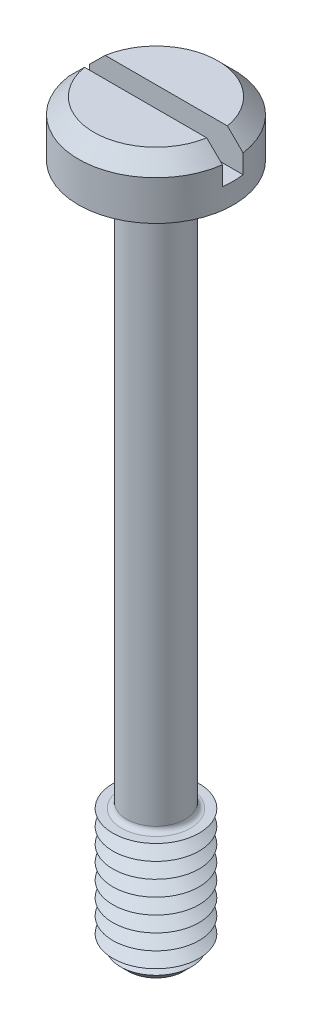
ISO-10303-21;
HEADER;
FILE_DESCRIPTION(('STEP AP214'),'2;1');
FILE_NAME('part.step','',(''),(''),'','','');
FILE_SCHEMA(('AUTOMOTIVE_DESIGN { 1 0 10303 214 1 1 1 1 }'));
ENDSEC;
DATA;
#1=APPLICATION_CONTEXT('core data for automotive mechanical design processes');
#2=APPLICATION_PROTOCOL_DEFINITION('international standard','automotive_design',2000,#1);
#3=PRODUCT_CONTEXT('',#1,'mechanical');
#4=PRODUCT('Part','Part','',(#3));
#5=PRODUCT_RELATED_PRODUCT_CATEGORY('part','',(#4));
#6=PRODUCT_DEFINITION_FORMATION('','',#4);
#7=PRODUCT_DEFINITION_CONTEXT('part definition',#1,'design');
#8=PRODUCT_DEFINITION('design','',#6,#7);
#9=PRODUCT_DEFINITION_SHAPE('','',#8);
#10=(LENGTH_UNIT() NAMED_UNIT(*) SI_UNIT(.MILLI.,.METRE.));
#11=(NAMED_UNIT(*) PLANE_ANGLE_UNIT() SI_UNIT($,.RADIAN.));
#12=(NAMED_UNIT(*) SI_UNIT($,.STERADIAN.) SOLID_ANGLE_UNIT());
#13=UNCERTAINTY_MEASURE_WITH_UNIT(LENGTH_MEASURE(1.E-05),#10,'distance_accuracy_value','');
#14=(GEOMETRIC_REPRESENTATION_CONTEXT(3) GLOBAL_UNCERTAINTY_ASSIGNED_CONTEXT((#13)) GLOBAL_UNIT_ASSIGNED_CONTEXT((#10,
#11,#12)) REPRESENTATION_CONTEXT('',''));
#15=CARTESIAN_POINT('',(0.,0.,0.));
#16=DIRECTION('',(0.,0.,1.));
#17=DIRECTION('',(1.,0.,0.));
#18=AXIS2_PLACEMENT_3D('',#15,#16,#17);
#19=CARTESIAN_POINT('',(0.,1.6,0.));
#20=DIRECTION('',(0.,1.,0.));
#21=DIRECTION('',(0.,0.,1.));
#22=AXIS2_PLACEMENT_3D('',#19,#20,#21);
#23=PLANE('',#22);
#24=DIRECTION('',(-1.,0.,0.));
#25=VECTOR('',#24,1.);
#26=CARTESIAN_POINT('',(2.25,1.6,-0.3));
#27=LINE('',#26,#25);
#28=CARTESIAN_POINT('',(1.77482393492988,1.6,-0.3));
#29=VERTEX_POINT('',#28);
#30=CARTESIAN_POINT('',(-1.77482393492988,1.6,-0.3));
#31=VERTEX_POINT('',#30);
#32=EDGE_CURVE('E110',#29,#31,#27,.T.);
#33=ORIENTED_EDGE('',*,*,#32,.F.);
#34=CARTESIAN_POINT('',(0.,1.6,0.));
#35=DIRECTION('',(0.,1.,0.));
#36=DIRECTION('',(0.,0.,1.));
#37=AXIS2_PLACEMENT_3D('',#34,#35,#36);
#38=CIRCLE('',#37,1.8);
#39=EDGE_CURVE('E113',#29,#31,#38,.T.);
#40=ORIENTED_EDGE('',*,*,#39,.T.);
#41=EDGE_LOOP('',(#33,#40));
#42=FACE_BOUND('',#41,.T.);
#43=ADVANCED_FACE('F39',(#42),#23,.T.);
#44=CARTESIAN_POINT('',(0.,1.6,0.));
#45=DIRECTION('',(0.,-1.,0.));
#46=DIRECTION('',(0.,0.,-1.));
#47=AXIS2_PLACEMENT_3D('',#44,#45,#46);
#48=CONICAL_SURFACE('',#47,1.8,0.785398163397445);
#49=CARTESIAN_POINT('',(4.95459224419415,-1.56366641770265,-0.3));
#50=CARTESIAN_POINT('',(4.78550585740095,-1.39489159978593,-0.3));
#51=CARTESIAN_POINT('',(4.61640599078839,-1.22613027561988,-0.3));
#52=CARTESIAN_POINT('',(4.27815962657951,-0.888649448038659,-0.3));
#53=CARTESIAN_POINT('',(4.10901312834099,-0.719929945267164,-0.3));
#54=CARTESIAN_POINT('',(3.77060374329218,-0.382497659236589,-0.3));
#55=CARTESIAN_POINT('',(3.60134083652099,-0.213784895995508,-0.3));
#56=CARTESIAN_POINT('',(3.26272497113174,0.123545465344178,-0.3));
#57=CARTESIAN_POINT('',(3.09337201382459,0.292163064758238,-0.3));
#58=CARTESIAN_POINT('',(2.74975444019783,0.633985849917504,-0.3));
#59=CARTESIAN_POINT('',(2.57548557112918,0.807186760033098,-0.3));
#60=CARTESIAN_POINT('',(2.22666801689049,1.15332162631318,-0.3));
#61=CARTESIAN_POINT('',(2.05211932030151,1.32625557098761,-0.3));
#62=CARTESIAN_POINT('',(1.78988225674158,1.58520097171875,-0.3));
#63=CARTESIAN_POINT('',(1.70241000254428,1.67143125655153,-0.3));
#64=CARTESIAN_POINT('',(1.52723599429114,1.84366185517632,-0.3));
#65=CARTESIAN_POINT('',(1.43953423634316,1.92966216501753,-0.3));
#66=CARTESIAN_POINT('',(1.26375483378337,2.10126365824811,-0.3));
#67=CARTESIAN_POINT('',(1.17567721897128,2.18686487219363,-0.3));
#68=CARTESIAN_POINT('',(0.998839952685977,2.35735922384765,-0.3));
#69=CARTESIAN_POINT('',(0.910080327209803,2.44225238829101,-0.3));
#70=CARTESIAN_POINT('',(0.796416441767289,2.54899153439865,-0.3));
#71=CARTESIAN_POINT('',(0.772225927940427,2.5715963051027,-0.3));
#72=CARTESIAN_POINT('',(0.723692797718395,2.61664290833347,-0.3));
#73=CARTESIAN_POINT('',(0.69935017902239,2.63908473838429,-0.3));
#74=CARTESIAN_POINT('',(0.65052808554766,2.68369783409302,-0.3));
#75=CARTESIAN_POINT('',(0.626049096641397,2.70586963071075,-0.3));
#76=CARTESIAN_POINT('',(0.576826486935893,2.74991696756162,-0.3));
#77=CARTESIAN_POINT('',(0.552082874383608,2.7717925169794,-0.3));
#78=CARTESIAN_POINT('',(0.495367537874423,2.82108684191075,-0.3));
#79=CARTESIAN_POINT('',(0.463281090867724,2.84837386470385,-0.3));
#80=CARTESIAN_POINT('',(0.398023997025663,2.90193742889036,-0.3));
#81=CARTESIAN_POINT('',(0.364849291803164,2.92820913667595,-0.3));
#82=CARTESIAN_POINT('',(0.313679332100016,2.96610502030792,-0.3));
#83=CARTESIAN_POINT('',(0.296293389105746,2.97854603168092,-0.3));
#84=CARTESIAN_POINT('',(0.260958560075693,3.00259516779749,-0.3));
#85=CARTESIAN_POINT('',(0.243009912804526,3.01420363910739,-0.3));
#86=CARTESIAN_POINT('',(0.206442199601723,3.03612496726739,-0.3));
#87=CARTESIAN_POINT('',(0.187826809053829,3.04644383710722,-0.3));
#88=CARTESIAN_POINT('',(0.149667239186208,3.06515059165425,-0.3));
#89=CARTESIAN_POINT('',(0.130125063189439,3.0735424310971,-0.3));
#90=CARTESIAN_POINT('',(0.0899770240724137,3.08736060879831,-0.3));
#91=CARTESIAN_POINT('',(0.0693720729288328,3.09278944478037,-0.3));
#92=CARTESIAN_POINT('',(0.0275643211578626,3.09943051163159,-0.3));
#93=CARTESIAN_POINT('',(0.00636584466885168,3.1006678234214,-0.3));
#94=CARTESIAN_POINT('',(-0.0358007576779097,3.09861060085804,-0.3));
#95=CARTESIAN_POINT('',(-0.0567687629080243,3.09531379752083,-0.3));
#96=CARTESIAN_POINT('',(-0.0978737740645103,3.08507807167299,-0.3));
#97=CARTESIAN_POINT('',(-0.11800430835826,3.07811501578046,-0.3));
#98=CARTESIAN_POINT('',(-0.16248330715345,3.05957916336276,-0.3));
#99=CARTESIAN_POINT('',(-0.186511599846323,3.04727044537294,-0.3));
#100=CARTESIAN_POINT('',(-0.233318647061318,3.02043354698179,-0.3));
#101=CARTESIAN_POINT('',(-0.256093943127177,3.00589960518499,-0.3));
#102=CARTESIAN_POINT('',(-0.300901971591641,2.97541580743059,-0.3));
#103=CARTESIAN_POINT('',(-0.322928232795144,2.95945657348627,-0.3));
#104=CARTESIAN_POINT('',(-0.366316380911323,2.92672827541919,-0.3));
#105=CARTESIAN_POINT('',(-0.387679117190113,2.90996032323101,-0.3));
#106=CARTESIAN_POINT('',(-0.43339480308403,2.87310399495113,-0.3));
#107=CARTESIAN_POINT('',(-0.457669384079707,2.85291891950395,-0.3));
#108=CARTESIAN_POINT('',(-0.505802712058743,2.81205752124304,-0.3));
#109=CARTESIAN_POINT('',(-0.529661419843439,2.79138115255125,-0.3));
#110=CARTESIAN_POINT('',(-0.600811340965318,2.72884009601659,-0.3));
#111=CARTESIAN_POINT('',(-0.647661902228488,2.68647545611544,-0.3));
#112=CARTESIAN_POINT('',(-0.740776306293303,2.60099002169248,-0.3));
#113=CARTESIAN_POINT('',(-0.787039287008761,2.55786829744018,-0.3));
#114=CARTESIAN_POINT('',(-0.879151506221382,2.47120207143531,-0.3));
#115=CARTESIAN_POINT('',(-0.925000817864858,2.4276576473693,-0.3));
#116=CARTESIAN_POINT('',(-1.06157343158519,2.29718252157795,-0.3));
#117=CARTESIAN_POINT('',(-1.15191647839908,2.20985470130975,-0.3));
#118=CARTESIAN_POINT('',(-1.33204374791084,2.03474740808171,-0.3));
#119=CARTESIAN_POINT('',(-1.42182830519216,1.94696827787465,-0.3));
#120=CARTESIAN_POINT('',(-1.65511823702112,1.71815111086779,-0.3));
#121=CARTESIAN_POINT('',(-1.79840096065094,1.57688614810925,-0.3));
#122=CARTESIAN_POINT('',(-2.08462326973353,1.2940074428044,-0.3));
#123=CARTESIAN_POINT('',(-2.22756285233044,1.15239369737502,-0.3));
#124=CARTESIAN_POINT('',(-2.65618391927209,0.727177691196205,-0.3));
#125=CARTESIAN_POINT('',(-2.94157972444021,0.443287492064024,-0.3));
#126=CARTESIAN_POINT('',(-3.51504981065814,-0.127735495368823,-0.3));
#127=CARTESIAN_POINT('',(-3.80312108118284,-0.414871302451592,-0.3));
#128=CARTESIAN_POINT('',(-4.37899985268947,-0.989219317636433,-0.3));
#129=CARTESIAN_POINT('',(-4.6668074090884,-1.27643147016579,-0.3));
#130=CARTESIAN_POINT('',(-4.95459224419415,-1.56366641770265,-0.3));
#131=B_SPLINE_CURVE_WITH_KNOTS('',3,(#49,#50,#51,#52,#53,#54,#55,#56,#57,#58,#59,#60,#61,#62,
#63,#64,#65,#66,#67,#68,#69,#70,#71,#72,#73,#74,#75,#76,#77,#78,#79,#80,#81,#82,#83,#84,#85,#86,
#87,#88,#89,#90,#91,#92,#93,#94,#95,#96,#97,#98,#99,#100,#101,#102,#103,#104,#105,#106,#107,
#108,#109,#110,#111,#112,#113,#114,#115,#116,#117,#118,#119,#120,#121,#122,#123,#124,#125,#126,
#127,#128,#129,#130),.UNSPECIFIED.,.F.,.F.,(4,2,2,2,2,2,2,2,2,2,2,2,2,2,2,2,2,2,2,2,2,2,2,2,2,2,
2,2,2,2,2,2,2,2,2,2,2,2,2,2,4),(0.,0.716712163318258,1.4334347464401,2.15039034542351,
2.86733577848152,3.60443392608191,4.34156295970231,4.71005096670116,5.07854526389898,
5.44701086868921,5.81546249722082,5.91478669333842,6.01411239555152,6.11319302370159,
6.21227057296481,6.33862193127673,6.46551497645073,6.52963544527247,6.59372906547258,
6.65751170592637,6.72116225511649,6.78475906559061,6.84797465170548,6.91122188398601,
6.97489074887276,7.05566851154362,7.13665907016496,7.21822852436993,7.29968885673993,
7.39438996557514,7.48909995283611,7.67857624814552,7.86830424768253,8.05799801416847,
8.43494407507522,8.81163695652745,9.4152671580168,10.0189023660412,11.2265436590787,
12.4467437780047,13.6665454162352),.UNSPECIFIED.);
#132=CARTESIAN_POINT('',(2.2299103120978,1.14999999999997,-0.3));
#133=VERTEX_POINT('',#132);
#134=EDGE_CURVE('E260',#133,#29,#131,.T.);
#135=ORIENTED_EDGE('',*,*,#134,.F.);
#136=CARTESIAN_POINT('',(0.,1.14999999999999,0.));
#137=DIRECTION('',(0.,1.,0.));
#138=DIRECTION('',(0.,0.,1.));
#139=AXIS2_PLACEMENT_3D('',#136,#137,#138);
#140=CIRCLE('',#139,2.25);
#141=CARTESIAN_POINT('',(-2.22991031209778,1.14999999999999,-0.3));
#142=VERTEX_POINT('',#141);
#143=EDGE_CURVE('E128',#142,#133,#140,.F.);
#144=ORIENTED_EDGE('',*,*,#143,.F.);
#145=EDGE_CURVE('E102',#31,#142,#131,.T.);
#146=ORIENTED_EDGE('',*,*,#145,.F.);
#147=ORIENTED_EDGE('',*,*,#39,.F.);
#148=EDGE_LOOP('',(#135,#144,#146,#147));
#149=FACE_BOUND('',#148,.T.);
#150=ADVANCED_FACE('F222',(#149),#48,.T.);
#151=CARTESIAN_POINT('',(0.,-20.,0.));
#152=DIRECTION('',(0.,1.,0.));
#153=DIRECTION('',(0.,0.,1.));
#154=AXIS2_PLACEMENT_3D('',#151,#152,#153);
#155=CYLINDRICAL_SURFACE('',#154,0.85);
#156=CARTESIAN_POINT('',(0.,-16.15,0.));
#157=DIRECTION('',(0.,-1.,0.));
#158=DIRECTION('',(0.,0.,-1.));
#159=AXIS2_PLACEMENT_3D('',#156,#157,#158);
#160=CIRCLE('',#159,0.85);
#161=CARTESIAN_POINT('',(0.,-16.15,-0.85));
#162=VERTEX_POINT('',#161);
#163=EDGE_CURVE('E123',#162,#162,#160,.F.);
#164=ORIENTED_EDGE('',*,*,#163,.T.);
#165=EDGE_LOOP('',(#164));
#166=FACE_BOUND('',#165,.T.);
#167=CARTESIAN_POINT('',(0.,-0.150000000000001,0.));
#168=DIRECTION('',(0.,1.,0.));
#169=DIRECTION('',(0.,0.,1.));
#170=AXIS2_PLACEMENT_3D('',#167,#168,#169);
#171=CIRCLE('',#170,0.85);
#172=CARTESIAN_POINT('',(0.,-0.150000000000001,0.85));
#173=VERTEX_POINT('',#172);
#174=EDGE_CURVE('E365',#173,#173,#171,.F.);
#175=ORIENTED_EDGE('',*,*,#174,.T.);
#176=EDGE_LOOP('',(#175));
#177=FACE_BOUND('',#176,.T.);
#178=ADVANCED_FACE('F218',(#166,#177),#155,.T.);
#179=CARTESIAN_POINT('',(0.,1.6,0.));
#180=DIRECTION('',(0.,-1.,0.));
#181=DIRECTION('',(0.,0.,-1.));
#182=AXIS2_PLACEMENT_3D('',#179,#180,#181);
#183=CYLINDRICAL_SURFACE('',#182,2.25);
#184=ORIENTED_EDGE('',*,*,#143,.T.);
#185=DIRECTION('',(0.,-1.,0.));
#186=VECTOR('',#185,1.);
#187=CARTESIAN_POINT('',(2.22991031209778,1.6,-0.3));
#188=LINE('',#187,#186);
#189=CARTESIAN_POINT('',(2.22991031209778,0.6,-0.3));
#190=VERTEX_POINT('',#189);
#191=EDGE_CURVE('E64',#133,#190,#188,.T.);
#192=ORIENTED_EDGE('',*,*,#191,.T.);
#193=CARTESIAN_POINT('',(0.,0.6,0.));
#194=DIRECTION('',(0.,1.,0.));
#195=DIRECTION('',(0.,0.,1.));
#196=AXIS2_PLACEMENT_3D('',#193,#194,#195);
#197=CIRCLE('',#196,2.25);
#198=CARTESIAN_POINT('',(2.22991031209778,0.6,0.3));
#199=VERTEX_POINT('',#198);
#200=EDGE_CURVE('E11',#199,#190,#197,.T.);
#201=ORIENTED_EDGE('',*,*,#200,.F.);
#202=DIRECTION('',(0.,-1.,0.));
#203=VECTOR('',#202,1.);
#204=CARTESIAN_POINT('',(2.22991031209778,1.6,0.3));
#205=LINE('',#204,#203);
#206=CARTESIAN_POINT('',(2.22991031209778,1.14999999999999,0.3));
#207=VERTEX_POINT('',#206);
#208=EDGE_CURVE('E274',#199,#207,#205,.F.);
#209=ORIENTED_EDGE('',*,*,#208,.T.);
#210=CARTESIAN_POINT('',(-2.2299103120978,1.14999999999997,0.3));
#211=VERTEX_POINT('',#210);
#212=EDGE_CURVE('E120',#207,#211,#140,.F.);
#213=ORIENTED_EDGE('',*,*,#212,.T.);
#214=DIRECTION('',(0.,-1.,0.));
#215=VECTOR('',#214,1.);
#216=CARTESIAN_POINT('',(-2.22991031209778,1.6,0.3));
#217=LINE('',#216,#215);
#218=CARTESIAN_POINT('',(-2.22991031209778,0.6,0.3));
#219=VERTEX_POINT('',#218);
#220=EDGE_CURVE('E96',#211,#219,#217,.T.);
#221=ORIENTED_EDGE('',*,*,#220,.T.);
#222=CARTESIAN_POINT('',(-2.22991031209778,0.6,-0.3));
#223=VERTEX_POINT('',#222);
#224=EDGE_CURVE('E44',#223,#219,#197,.T.);
#225=ORIENTED_EDGE('',*,*,#224,.F.);
#226=DIRECTION('',(0.,-1.,0.));
#227=VECTOR('',#226,1.);
#228=CARTESIAN_POINT('',(-2.22991031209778,1.6,-0.3));
#229=LINE('',#228,#227);
#230=EDGE_CURVE('E278',#223,#142,#229,.F.);
#231=ORIENTED_EDGE('',*,*,#230,.T.);
#232=EDGE_LOOP('',(#184,#192,#201,#209,#213,#221,#225,#231));
#233=FACE_BOUND('',#232,.T.);
#234=CARTESIAN_POINT('',(0.,0.,0.));
#235=DIRECTION('',(0.,1.,0.));
#236=DIRECTION('',(0.,0.,1.));
#237=AXIS2_PLACEMENT_3D('',#234,#235,#236);
#238=CIRCLE('',#237,2.25);
#239=CARTESIAN_POINT('',(0.,0.,2.25));
#240=VERTEX_POINT('',#239);
#241=EDGE_CURVE('E350',#240,#240,#238,.T.);
#242=ORIENTED_EDGE('',*,*,#241,.T.);
#243=EDGE_LOOP('',(#242));
#244=FACE_BOUND('',#243,.T.);
#245=ADVANCED_FACE('F221',(#233,#244),#183,.T.);
#246=DIRECTION('',(1.,0.,0.));
#247=VECTOR('',#246,1.);
#248=CARTESIAN_POINT('',(2.25,1.6,0.3));
#249=LINE('',#248,#247);
#250=CARTESIAN_POINT('',(-1.77482393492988,1.6,0.3));
#251=VERTEX_POINT('',#250);
#252=CARTESIAN_POINT('',(1.77482393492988,1.6,0.3));
#253=VERTEX_POINT('',#252);
#254=EDGE_CURVE('E56',#251,#253,#249,.T.);
#255=ORIENTED_EDGE('',*,*,#254,.F.);
#256=EDGE_CURVE('E108',#251,#253,#38,.T.);
#257=ORIENTED_EDGE('',*,*,#256,.T.);
#258=EDGE_LOOP('',(#255,#257));
#259=FACE_BOUND('',#258,.T.);
#260=ADVANCED_FACE('F107',(#259),#23,.T.);
#261=CARTESIAN_POINT('',(0.,0.,0.));
#262=DIRECTION('',(0.,1.,0.));
#263=DIRECTION('',(0.,0.,1.));
#264=AXIS2_PLACEMENT_3D('',#261,#262,#263);
#265=PLANE('',#264);
#266=CARTESIAN_POINT('',(0.,0.,0.));
#267=DIRECTION('',(0.,1.,0.));
#268=DIRECTION('',(0.,0.,1.));
#269=AXIS2_PLACEMENT_3D('',#266,#267,#268);
#270=CIRCLE('',#269,1.);
#271=CARTESIAN_POINT('',(0.,0.,1.));
#272=VERTEX_POINT('',#271);
#273=EDGE_CURVE('E114',#272,#272,#270,.T.);
#274=ORIENTED_EDGE('',*,*,#273,.T.);
#275=EDGE_LOOP('',(#274));
#276=FACE_BOUND('',#275,.T.);
#277=ORIENTED_EDGE('',*,*,#241,.F.);
#278=EDGE_LOOP('',(#277));
#279=FACE_BOUND('',#278,.T.);
#280=ADVANCED_FACE('F212',(#276,#279),#265,.F.);
#281=CARTESIAN_POINT('',(0.,-16.3,0.));
#282=DIRECTION('',(0.,-1.,0.));
#283=DIRECTION('',(0.,0.,-1.));
#284=AXIS2_PLACEMENT_3D('',#281,#282,#283);
#285=PLANE('',#284);
#286=CARTESIAN_POINT('',(0.,-16.3,0.));
#287=DIRECTION('',(0.,-1.,0.));
#288=DIRECTION('',(0.,0.,-1.));
#289=AXIS2_PLACEMENT_3D('',#286,#287,#288);
#290=CIRCLE('',#289,1.);
#291=CARTESIAN_POINT('',(0.,-16.3,-1.));
#292=VERTEX_POINT('',#291);
#293=EDGE_CURVE('E358',#292,#292,#290,.T.);
#294=ORIENTED_EDGE('',*,*,#293,.T.);
#295=EDGE_LOOP('',(#294));
#296=FACE_BOUND('',#295,.T.);
#297=CARTESIAN_POINT('',(0.,-16.3,0.));
#298=DIRECTION('',(0.,1.,0.));
#299=DIRECTION('',(0.,0.,1.));
#300=AXIS2_PLACEMENT_3D('',#297,#298,#299);
#301=CIRCLE('',#300,1.25);
#302=CARTESIAN_POINT('',(0.,-16.3,1.25));
#303=VERTEX_POINT('',#302);
#304=EDGE_CURVE('E346',#303,#303,#301,.T.);
#305=ORIENTED_EDGE('',*,*,#304,.T.);
#306=EDGE_LOOP('',(#305));
#307=FACE_BOUND('',#306,.T.);
#308=ADVANCED_FACE('F208',(#296,#307),#285,.F.);
#309=CARTESIAN_POINT('',(0.,-16.525,0.));
#310=DIRECTION('',(0.,1.,0.));
#311=DIRECTION('',(0.,0.,1.));
#312=AXIS2_PLACEMENT_3D('',#309,#310,#311);
#313=CONICAL_SURFACE('',#312,0.860288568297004,1.0471975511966);
#314=ORIENTED_EDGE('',*,*,#304,.F.);
#315=EDGE_LOOP('',(#314));
#316=FACE_BOUND('',#315,.T.);
#317=CARTESIAN_POINT('',(0.,-16.525,0.));
#318=DIRECTION('',(0.,1.,0.));
#319=DIRECTION('',(0.,0.,1.));
#320=AXIS2_PLACEMENT_3D('',#317,#318,#319);
#321=CIRCLE('',#320,0.860288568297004);
#322=CARTESIAN_POINT('',(0.,-16.525,0.860288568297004));
#323=VERTEX_POINT('',#322);
#324=EDGE_CURVE('E342',#323,#323,#321,.T.);
#325=ORIENTED_EDGE('',*,*,#324,.T.);
#326=EDGE_LOOP('',(#325));
#327=FACE_BOUND('',#326,.T.);
#328=ADVANCED_FACE('F204',(#316,#327),#313,.T.);
#329=CARTESIAN_POINT('',(0.,-16.75,0.));
#330=DIRECTION('',(0.,-1.,0.));
#331=DIRECTION('',(0.,0.,-1.));
#332=AXIS2_PLACEMENT_3D('',#329,#330,#331);
#333=CONICAL_SURFACE('',#332,1.25,1.04719755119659);
#334=ORIENTED_EDGE('',*,*,#324,.F.);
#335=EDGE_LOOP('',(#334));
#336=FACE_BOUND('',#335,.T.);
#337=CARTESIAN_POINT('',(0.,-16.75,0.));
#338=DIRECTION('',(0.,1.,0.));
#339=DIRECTION('',(0.,0.,1.));
#340=AXIS2_PLACEMENT_3D('',#337,#338,#339);
#341=CIRCLE('',#340,1.25);
#342=CARTESIAN_POINT('',(0.,-16.75,1.25));
#343=VERTEX_POINT('',#342);
#344=EDGE_CURVE('E338',#343,#343,#341,.T.);
#345=ORIENTED_EDGE('',*,*,#344,.T.);
#346=EDGE_LOOP('',(#345));
#347=FACE_BOUND('',#346,.T.);
#348=ADVANCED_FACE('F200',(#336,#347),#333,.T.);
#349=CARTESIAN_POINT('',(0.,-16.975,0.));
#350=DIRECTION('',(0.,1.,0.));
#351=DIRECTION('',(0.,0.,1.));
#352=AXIS2_PLACEMENT_3D('',#349,#350,#351);
#353=CONICAL_SURFACE('',#352,0.860288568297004,1.0471975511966);
#354=ORIENTED_EDGE('',*,*,#344,.F.);
#355=EDGE_LOOP('',(#354));
#356=FACE_BOUND('',#355,.T.);
#357=CARTESIAN_POINT('',(0.,-16.975,0.));
#358=DIRECTION('',(0.,1.,0.));
#359=DIRECTION('',(0.,0.,1.));
#360=AXIS2_PLACEMENT_3D('',#357,#358,#359);
#361=CIRCLE('',#360,0.860288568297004);
#362=CARTESIAN_POINT('',(0.,-16.975,0.860288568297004));
#363=VERTEX_POINT('',#362);
#364=EDGE_CURVE('E334',#363,#363,#361,.T.);
#365=ORIENTED_EDGE('',*,*,#364,.T.);
#366=EDGE_LOOP('',(#365));
#367=FACE_BOUND('',#366,.T.);
#368=ADVANCED_FACE('F196',(#356,#367),#353,.T.);
#369=CARTESIAN_POINT('',(0.,-17.2,0.));
#370=DIRECTION('',(0.,-1.,0.));
#371=DIRECTION('',(0.,0.,-1.));
#372=AXIS2_PLACEMENT_3D('',#369,#370,#371);
#373=CONICAL_SURFACE('',#372,1.25,1.04719755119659);
#374=ORIENTED_EDGE('',*,*,#364,.F.);
#375=EDGE_LOOP('',(#374));
#376=FACE_BOUND('',#375,.T.);
#377=CARTESIAN_POINT('',(0.,-17.2,0.));
#378=DIRECTION('',(0.,1.,0.));
#379=DIRECTION('',(0.,0.,1.));
#380=AXIS2_PLACEMENT_3D('',#377,#378,#379);
#381=CIRCLE('',#380,1.25);
#382=CARTESIAN_POINT('',(0.,-17.2,1.25));
#383=VERTEX_POINT('',#382);
#384=EDGE_CURVE('E330',#383,#383,#381,.T.);
#385=ORIENTED_EDGE('',*,*,#384,.T.);
#386=EDGE_LOOP('',(#385));
#387=FACE_BOUND('',#386,.T.);
#388=ADVANCED_FACE('F192',(#376,#387),#373,.T.);
#389=CARTESIAN_POINT('',(0.,-17.425,0.));
#390=DIRECTION('',(0.,1.,0.));
#391=DIRECTION('',(0.,0.,1.));
#392=AXIS2_PLACEMENT_3D('',#389,#390,#391);
#393=CONICAL_SURFACE('',#392,0.860288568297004,1.0471975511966);
#394=ORIENTED_EDGE('',*,*,#384,.F.);
#395=EDGE_LOOP('',(#394));
#396=FACE_BOUND('',#395,.T.);
#397=CARTESIAN_POINT('',(0.,-17.425,0.));
#398=DIRECTION('',(0.,1.,0.));
#399=DIRECTION('',(0.,0.,1.));
#400=AXIS2_PLACEMENT_3D('',#397,#398,#399);
#401=CIRCLE('',#400,0.860288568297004);
#402=CARTESIAN_POINT('',(0.,-17.425,0.860288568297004));
#403=VERTEX_POINT('',#402);
#404=EDGE_CURVE('E326',#403,#403,#401,.T.);
#405=ORIENTED_EDGE('',*,*,#404,.T.);
#406=EDGE_LOOP('',(#405));
#407=FACE_BOUND('',#406,.T.);
#408=ADVANCED_FACE('F188',(#396,#407),#393,.T.);
#409=CARTESIAN_POINT('',(0.,-17.65,0.));
#410=DIRECTION('',(0.,-1.,0.));
#411=DIRECTION('',(0.,0.,-1.));
#412=AXIS2_PLACEMENT_3D('',#409,#410,#411);
#413=CONICAL_SURFACE('',#412,1.25,1.04719755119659);
#414=ORIENTED_EDGE('',*,*,#404,.F.);
#415=EDGE_LOOP('',(#414));
#416=FACE_BOUND('',#415,.T.);
#417=CARTESIAN_POINT('',(0.,-17.65,0.));
#418=DIRECTION('',(0.,1.,0.));
#419=DIRECTION('',(0.,0.,1.));
#420=AXIS2_PLACEMENT_3D('',#417,#418,#419);
#421=CIRCLE('',#420,1.25);
#422=CARTESIAN_POINT('',(0.,-17.65,1.25));
#423=VERTEX_POINT('',#422);
#424=EDGE_CURVE('E322',#423,#423,#421,.T.);
#425=ORIENTED_EDGE('',*,*,#424,.T.);
#426=EDGE_LOOP('',(#425));
#427=FACE_BOUND('',#426,.T.);
#428=ADVANCED_FACE('F184',(#416,#427),#413,.T.);
#429=CARTESIAN_POINT('',(0.,-17.875,0.));
#430=DIRECTION('',(0.,1.,0.));
#431=DIRECTION('',(0.,0.,1.));
#432=AXIS2_PLACEMENT_3D('',#429,#430,#431);
#433=CONICAL_SURFACE('',#432,0.860288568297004,1.0471975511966);
#434=ORIENTED_EDGE('',*,*,#424,.F.);
#435=EDGE_LOOP('',(#434));
#436=FACE_BOUND('',#435,.T.);
#437=CARTESIAN_POINT('',(0.,-17.875,0.));
#438=DIRECTION('',(0.,1.,0.));
#439=DIRECTION('',(0.,0.,1.));
#440=AXIS2_PLACEMENT_3D('',#437,#438,#439);
#441=CIRCLE('',#440,0.860288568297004);
#442=CARTESIAN_POINT('',(0.,-17.875,0.860288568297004));
#443=VERTEX_POINT('',#442);
#444=EDGE_CURVE('E318',#443,#443,#441,.T.);
#445=ORIENTED_EDGE('',*,*,#444,.T.);
#446=EDGE_LOOP('',(#445));
#447=FACE_BOUND('',#446,.T.);
#448=ADVANCED_FACE('F180',(#436,#447),#433,.T.);
#449=CARTESIAN_POINT('',(0.,-18.1,0.));
#450=DIRECTION('',(0.,-1.,0.));
#451=DIRECTION('',(0.,0.,-1.));
#452=AXIS2_PLACEMENT_3D('',#449,#450,#451);
#453=CONICAL_SURFACE('',#452,1.25,1.04719755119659);
#454=ORIENTED_EDGE('',*,*,#444,.F.);
#455=EDGE_LOOP('',(#454));
#456=FACE_BOUND('',#455,.T.);
#457=CARTESIAN_POINT('',(0.,-18.1,0.));
#458=DIRECTION('',(0.,1.,0.));
#459=DIRECTION('',(0.,0.,1.));
#460=AXIS2_PLACEMENT_3D('',#457,#458,#459);
#461=CIRCLE('',#460,1.25);
#462=CARTESIAN_POINT('',(0.,-18.1,1.25));
#463=VERTEX_POINT('',#462);
#464=EDGE_CURVE('E315',#463,#463,#461,.T.);
#465=ORIENTED_EDGE('',*,*,#464,.T.);
#466=EDGE_LOOP('',(#465));
#467=FACE_BOUND('',#466,.T.);
#468=ADVANCED_FACE('F176',(#456,#467),#453,.T.);
#469=CARTESIAN_POINT('',(0.,-18.325,0.));
#470=DIRECTION('',(0.,1.,0.));
#471=DIRECTION('',(0.,0.,1.));
#472=AXIS2_PLACEMENT_3D('',#469,#470,#471);
#473=CONICAL_SURFACE('',#472,0.860288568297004,1.0471975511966);
#474=ORIENTED_EDGE('',*,*,#464,.F.);
#475=EDGE_LOOP('',(#474));
#476=FACE_BOUND('',#475,.T.);
#477=CARTESIAN_POINT('',(0.,-18.325,0.));
#478=DIRECTION('',(0.,1.,0.));
#479=DIRECTION('',(0.,0.,1.));
#480=AXIS2_PLACEMENT_3D('',#477,#478,#479);
#481=CIRCLE('',#480,0.860288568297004);
#482=CARTESIAN_POINT('',(0.,-18.325,0.860288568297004));
#483=VERTEX_POINT('',#482);
#484=EDGE_CURVE('E312',#483,#483,#481,.T.);
#485=ORIENTED_EDGE('',*,*,#484,.T.);
#486=EDGE_LOOP('',(#485));
#487=FACE_BOUND('',#486,.T.);
#488=ADVANCED_FACE('F172',(#476,#487),#473,.T.);
#489=CARTESIAN_POINT('',(0.,-18.55,0.));
#490=DIRECTION('',(0.,-1.,0.));
#491=DIRECTION('',(0.,0.,-1.));
#492=AXIS2_PLACEMENT_3D('',#489,#490,#491);
#493=CONICAL_SURFACE('',#492,1.25,1.04719755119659);
#494=ORIENTED_EDGE('',*,*,#484,.F.);
#495=EDGE_LOOP('',(#494));
#496=FACE_BOUND('',#495,.T.);
#497=CARTESIAN_POINT('',(0.,-18.55,0.));
#498=DIRECTION('',(0.,1.,0.));
#499=DIRECTION('',(0.,0.,1.));
#500=AXIS2_PLACEMENT_3D('',#497,#498,#499);
#501=CIRCLE('',#500,1.25);
#502=CARTESIAN_POINT('',(0.,-18.55,1.25));
#503=VERTEX_POINT('',#502);
#504=EDGE_CURVE('E308',#503,#503,#501,.T.);
#505=ORIENTED_EDGE('',*,*,#504,.T.);
#506=EDGE_LOOP('',(#505));
#507=FACE_BOUND('',#506,.T.);
#508=ADVANCED_FACE('F168',(#496,#507),#493,.T.);
#509=CARTESIAN_POINT('',(0.,-18.775,0.));
#510=DIRECTION('',(0.,1.,0.));
#511=DIRECTION('',(0.,0.,1.));
#512=AXIS2_PLACEMENT_3D('',#509,#510,#511);
#513=CONICAL_SURFACE('',#512,0.860288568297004,1.0471975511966);
#514=ORIENTED_EDGE('',*,*,#504,.F.);
#515=EDGE_LOOP('',(#514));
#516=FACE_BOUND('',#515,.T.);
#517=CARTESIAN_POINT('',(0.,-18.775,0.));
#518=DIRECTION('',(0.,1.,0.));
#519=DIRECTION('',(0.,0.,1.));
#520=AXIS2_PLACEMENT_3D('',#517,#518,#519);
#521=CIRCLE('',#520,0.860288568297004);
#522=CARTESIAN_POINT('',(0.,-18.775,0.860288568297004));
#523=VERTEX_POINT('',#522);
#524=EDGE_CURVE('E304',#523,#523,#521,.T.);
#525=ORIENTED_EDGE('',*,*,#524,.T.);
#526=EDGE_LOOP('',(#525));
#527=FACE_BOUND('',#526,.T.);
#528=ADVANCED_FACE('F164',(#516,#527),#513,.T.);
#529=CARTESIAN_POINT('',(0.,-19.,0.));
#530=DIRECTION('',(0.,-1.,0.));
#531=DIRECTION('',(0.,0.,-1.));
#532=AXIS2_PLACEMENT_3D('',#529,#530,#531);
#533=CONICAL_SURFACE('',#532,1.25,1.04719755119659);
#534=ORIENTED_EDGE('',*,*,#524,.F.);
#535=EDGE_LOOP('',(#534));
#536=FACE_BOUND('',#535,.T.);
#537=CARTESIAN_POINT('',(0.,-19.,0.));
#538=DIRECTION('',(0.,1.,0.));
#539=DIRECTION('',(0.,0.,1.));
#540=AXIS2_PLACEMENT_3D('',#537,#538,#539);
#541=CIRCLE('',#540,1.25);
#542=CARTESIAN_POINT('',(0.,-19.,1.25));
#543=VERTEX_POINT('',#542);
#544=EDGE_CURVE('E300',#543,#543,#541,.T.);
#545=ORIENTED_EDGE('',*,*,#544,.T.);
#546=EDGE_LOOP('',(#545));
#547=FACE_BOUND('',#546,.T.);
#548=ADVANCED_FACE('F160',(#536,#547),#533,.T.);
#549=CARTESIAN_POINT('',(0.,-19.225,0.));
#550=DIRECTION('',(0.,1.,0.));
#551=DIRECTION('',(0.,0.,1.));
#552=AXIS2_PLACEMENT_3D('',#549,#550,#551);
#553=CONICAL_SURFACE('',#552,0.860288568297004,1.0471975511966);
#554=ORIENTED_EDGE('',*,*,#544,.F.);
#555=EDGE_LOOP('',(#554));
#556=FACE_BOUND('',#555,.T.);
#557=CARTESIAN_POINT('',(0.,-19.225,0.));
#558=DIRECTION('',(0.,1.,0.));
#559=DIRECTION('',(0.,0.,1.));
#560=AXIS2_PLACEMENT_3D('',#557,#558,#559);
#561=CIRCLE('',#560,0.860288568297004);
#562=CARTESIAN_POINT('',(0.,-19.225,0.860288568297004));
#563=VERTEX_POINT('',#562);
#564=EDGE_CURVE('E296',#563,#563,#561,.T.);
#565=ORIENTED_EDGE('',*,*,#564,.T.);
#566=EDGE_LOOP('',(#565));
#567=FACE_BOUND('',#566,.T.);
#568=ADVANCED_FACE('F156',(#556,#567),#553,.T.);
#569=CARTESIAN_POINT('',(0.,-19.45,0.));
#570=DIRECTION('',(0.,-1.,0.));
#571=DIRECTION('',(0.,0.,-1.));
#572=AXIS2_PLACEMENT_3D('',#569,#570,#571);
#573=CONICAL_SURFACE('',#572,1.25,1.04719755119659);
#574=ORIENTED_EDGE('',*,*,#564,.F.);
#575=EDGE_LOOP('',(#574));
#576=FACE_BOUND('',#575,.T.);
#577=CARTESIAN_POINT('',(0.,-19.45,0.));
#578=DIRECTION('',(0.,1.,0.));
#579=DIRECTION('',(0.,0.,1.));
#580=AXIS2_PLACEMENT_3D('',#577,#578,#579);
#581=CIRCLE('',#580,1.25);
#582=CARTESIAN_POINT('',(0.,-19.45,1.25));
#583=VERTEX_POINT('',#582);
#584=EDGE_CURVE('E291',#583,#583,#581,.T.);
#585=ORIENTED_EDGE('',*,*,#584,.T.);
#586=EDGE_LOOP('',(#585));
#587=FACE_BOUND('',#586,.T.);
#588=ADVANCED_FACE('F152',(#576,#587),#573,.T.);
#589=CARTESIAN_POINT('',(0.,-19.675,0.));
#590=DIRECTION('',(0.,1.,0.));
#591=DIRECTION('',(0.,0.,1.));
#592=AXIS2_PLACEMENT_3D('',#589,#590,#591);
#593=CONICAL_SURFACE('',#592,0.860288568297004,1.0471975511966);
#594=ORIENTED_EDGE('',*,*,#584,.F.);
#595=EDGE_LOOP('',(#594));
#596=FACE_BOUND('',#595,.T.);
#597=CARTESIAN_POINT('',(0.,-19.675,0.));
#598=DIRECTION('',(0.,1.,0.));
#599=DIRECTION('',(0.,0.,1.));
#600=AXIS2_PLACEMENT_3D('',#597,#598,#599);
#601=CIRCLE('',#600,0.860288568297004);
#602=CARTESIAN_POINT('',(0.,-19.675,0.860288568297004));
#603=VERTEX_POINT('',#602);
#604=EDGE_CURVE('E287',#603,#603,#601,.T.);
#605=ORIENTED_EDGE('',*,*,#604,.T.);
#606=EDGE_LOOP('',(#605));
#607=FACE_BOUND('',#606,.T.);
#608=ADVANCED_FACE('F148',(#596,#607),#593,.T.);
#609=CARTESIAN_POINT('',(0.,-19.9,0.));
#610=DIRECTION('',(0.,-1.,0.));
#611=DIRECTION('',(0.,0.,-1.));
#612=AXIS2_PLACEMENT_3D('',#609,#610,#611);
#613=CONICAL_SURFACE('',#612,1.25,1.04719755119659);
#614=CARTESIAN_POINT('',(0.,-19.7718911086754,0.));
#615=DIRECTION('',(0.,-1.,0.));
#616=DIRECTION('',(0.,0.,-1.));
#617=AXIS2_PLACEMENT_3D('',#614,#615,#616);
#618=CIRCLE('',#617,1.02810889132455);
#619=CARTESIAN_POINT('',(0.,-19.7718911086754,-1.02810889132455));
#620=VERTEX_POINT('',#619);
#621=EDGE_CURVE('E295',#620,#620,#618,.F.);
#622=ORIENTED_EDGE('',*,*,#621,.T.);
#623=EDGE_LOOP('',(#622));
#624=FACE_BOUND('',#623,.T.);
#625=ORIENTED_EDGE('',*,*,#604,.F.);
#626=EDGE_LOOP('',(#625));
#627=FACE_BOUND('',#626,.T.);
#628=ADVANCED_FACE('F144',(#624,#627),#613,.T.);
#629=CARTESIAN_POINT('',(0.,-20.,0.));
#630=DIRECTION('',(0.,-1.,0.));
#631=DIRECTION('',(0.,0.,-1.));
#632=AXIS2_PLACEMENT_3D('',#629,#630,#631);
#633=PLANE('',#632);
#634=CARTESIAN_POINT('',(0.,-20.,0.));
#635=DIRECTION('',(0.,-1.,0.));
#636=DIRECTION('',(0.,0.,-1.));
#637=AXIS2_PLACEMENT_3D('',#634,#635,#636);
#638=CIRCLE('',#637,0.800000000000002);
#639=CARTESIAN_POINT('',(0.,-20.,-0.800000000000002));
#640=VERTEX_POINT('',#639);
#641=EDGE_CURVE('E354',#640,#640,#638,.T.);
#642=ORIENTED_EDGE('',*,*,#641,.T.);
#643=EDGE_LOOP('',(#642));
#644=FACE_BOUND('',#643,.T.);
#645=ADVANCED_FACE('F147',(#644),#633,.T.);
#646=CARTESIAN_POINT('',(0.,-20.,0.));
#647=DIRECTION('',(0.,1.,0.));
#648=DIRECTION('',(0.,0.,1.));
#649=AXIS2_PLACEMENT_3D('',#646,#647,#648);
#650=CONICAL_SURFACE('',#649,0.800000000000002,0.785398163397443);
#651=ORIENTED_EDGE('',*,*,#621,.F.);
#652=EDGE_LOOP('',(#651));
#653=FACE_BOUND('',#652,.T.);
#654=ORIENTED_EDGE('',*,*,#641,.F.);
#655=EDGE_LOOP('',(#654));
#656=FACE_BOUND('',#655,.T.);
#657=ADVANCED_FACE('F216',(#653,#656),#650,.T.);
#658=CARTESIAN_POINT('',(0.,-16.15,0.));
#659=DIRECTION('',(0.,-1.,0.));
#660=DIRECTION('',(0.,0.,-1.));
#661=AXIS2_PLACEMENT_3D('',#658,#659,#660);
#662=TOROIDAL_SURFACE('',#661,1.,0.15);
#663=ORIENTED_EDGE('',*,*,#163,.F.);
#664=EDGE_LOOP('',(#663));
#665=FACE_BOUND('',#664,.T.);
#666=ORIENTED_EDGE('',*,*,#293,.F.);
#667=EDGE_LOOP('',(#666));
#668=FACE_BOUND('',#667,.T.);
#669=ADVANCED_FACE('F234',(#665,#668),#662,.F.);
#670=CARTESIAN_POINT('',(0.,-0.150000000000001,0.));
#671=DIRECTION('',(0.,1.,0.));
#672=DIRECTION('',(0.,0.,1.));
#673=AXIS2_PLACEMENT_3D('',#670,#671,#672);
#674=TOROIDAL_SURFACE('',#673,1.,0.15);
#675=ORIENTED_EDGE('',*,*,#273,.F.);
#676=EDGE_LOOP('',(#675));
#677=FACE_BOUND('',#676,.T.);
#678=ORIENTED_EDGE('',*,*,#174,.F.);
#679=EDGE_LOOP('',(#678));
#680=FACE_BOUND('',#679,.T.);
#681=ADVANCED_FACE('F237',(#677,#680),#674,.F.);
#682=CARTESIAN_POINT('',(-4.95459224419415,-1.56366641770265,0.3));
#683=CARTESIAN_POINT('',(-4.78550585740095,-1.39489159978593,0.3));
#684=CARTESIAN_POINT('',(-4.6164059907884,-1.22613027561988,0.3));
#685=CARTESIAN_POINT('',(-4.27815962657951,-0.888649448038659,0.3));
#686=CARTESIAN_POINT('',(-4.10901312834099,-0.719929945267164,0.3));
#687=CARTESIAN_POINT('',(-3.77060374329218,-0.382497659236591,0.3));
#688=CARTESIAN_POINT('',(-3.60134083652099,-0.213784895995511,0.3));
#689=CARTESIAN_POINT('',(-3.26272497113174,0.123545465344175,0.3));
#690=CARTESIAN_POINT('',(-3.09337201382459,0.292163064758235,0.3));
#691=CARTESIAN_POINT('',(-2.74975444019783,0.633985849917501,0.3));
#692=CARTESIAN_POINT('',(-2.57548557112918,0.807186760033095,0.3));
#693=CARTESIAN_POINT('',(-2.22666801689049,1.15332162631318,0.3));
#694=CARTESIAN_POINT('',(-2.05211932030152,1.32625557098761,0.3));
#695=CARTESIAN_POINT('',(-1.78988225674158,1.58520097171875,0.3));
#696=CARTESIAN_POINT('',(-1.70241000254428,1.67143125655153,0.3));
#697=CARTESIAN_POINT('',(-1.52723599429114,1.84366185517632,0.3));
#698=CARTESIAN_POINT('',(-1.43953423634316,1.92966216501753,0.3));
#699=CARTESIAN_POINT('',(-1.26375483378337,2.10126365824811,0.3));
#700=CARTESIAN_POINT('',(-1.17567721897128,2.18686487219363,0.3));
#701=CARTESIAN_POINT('',(-0.998839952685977,2.35735922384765,0.3));
#702=CARTESIAN_POINT('',(-0.910080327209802,2.44225238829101,0.3));
#703=CARTESIAN_POINT('',(-0.796416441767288,2.54899153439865,0.3));
#704=CARTESIAN_POINT('',(-0.772225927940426,2.5715963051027,0.3));
#705=CARTESIAN_POINT('',(-0.723692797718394,2.61664290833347,0.3));
#706=CARTESIAN_POINT('',(-0.699350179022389,2.63908473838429,0.3));
#707=CARTESIAN_POINT('',(-0.65052808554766,2.68369783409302,0.3));
#708=CARTESIAN_POINT('',(-0.626049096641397,2.70586963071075,0.3));
#709=CARTESIAN_POINT('',(-0.576826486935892,2.74991696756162,0.3));
#710=CARTESIAN_POINT('',(-0.552082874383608,2.7717925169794,0.3));
#711=CARTESIAN_POINT('',(-0.495367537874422,2.82108684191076,0.3));
#712=CARTESIAN_POINT('',(-0.463281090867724,2.84837386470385,0.3));
#713=CARTESIAN_POINT('',(-0.398023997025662,2.90193742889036,0.3));
#714=CARTESIAN_POINT('',(-0.364849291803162,2.92820913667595,0.3));
#715=CARTESIAN_POINT('',(-0.313679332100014,2.96610502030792,0.3));
#716=CARTESIAN_POINT('',(-0.296293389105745,2.97854603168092,0.3));
#717=CARTESIAN_POINT('',(-0.260958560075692,3.00259516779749,0.3));
#718=CARTESIAN_POINT('',(-0.243009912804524,3.01420363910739,0.3));
#719=CARTESIAN_POINT('',(-0.206442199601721,3.03612496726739,0.3));
#720=CARTESIAN_POINT('',(-0.187826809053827,3.04644383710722,0.3));
#721=CARTESIAN_POINT('',(-0.149667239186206,3.06515059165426,0.3));
#722=CARTESIAN_POINT('',(-0.130125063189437,3.0735424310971,0.3));
#723=CARTESIAN_POINT('',(-0.0899770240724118,3.08736060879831,0.3));
#724=CARTESIAN_POINT('',(-0.0693720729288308,3.09278944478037,0.3));
#725=CARTESIAN_POINT('',(-0.0275643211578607,3.09943051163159,0.3));
#726=CARTESIAN_POINT('',(-0.00636584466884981,3.1006678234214,0.3));
#727=CARTESIAN_POINT('',(0.0358007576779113,3.09861060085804,0.3));
#728=CARTESIAN_POINT('',(0.0567687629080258,3.09531379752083,0.3));
#729=CARTESIAN_POINT('',(0.0978737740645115,3.08507807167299,0.3));
#730=CARTESIAN_POINT('',(0.118004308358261,3.07811501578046,0.3));
#731=CARTESIAN_POINT('',(0.162483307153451,3.05957916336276,0.3));
#732=CARTESIAN_POINT('',(0.186511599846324,3.04727044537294,0.3));
#733=CARTESIAN_POINT('',(0.23331864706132,3.02043354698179,0.3));
#734=CARTESIAN_POINT('',(0.256093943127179,3.00589960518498,0.3));
#735=CARTESIAN_POINT('',(0.300901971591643,2.97541580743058,0.3));
#736=CARTESIAN_POINT('',(0.322928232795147,2.95945657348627,0.3));
#737=CARTESIAN_POINT('',(0.366316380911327,2.92672827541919,0.3));
#738=CARTESIAN_POINT('',(0.387679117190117,2.90996032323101,0.3));
#739=CARTESIAN_POINT('',(0.433394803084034,2.87310399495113,0.3));
#740=CARTESIAN_POINT('',(0.457669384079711,2.85291891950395,0.3));
#741=CARTESIAN_POINT('',(0.505802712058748,2.81205752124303,0.3));
#742=CARTESIAN_POINT('',(0.529661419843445,2.79138115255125,0.3));
#743=CARTESIAN_POINT('',(0.600811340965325,2.72884009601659,0.3));
#744=CARTESIAN_POINT('',(0.647661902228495,2.68647545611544,0.3));
#745=CARTESIAN_POINT('',(0.740776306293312,2.60099002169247,0.3));
#746=CARTESIAN_POINT('',(0.787039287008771,2.55786829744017,0.3));
#747=CARTESIAN_POINT('',(0.879151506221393,2.4712020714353,0.3));
#748=CARTESIAN_POINT('',(0.92500081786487,2.42765764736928,0.3));
#749=CARTESIAN_POINT('',(1.0615734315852,2.29718252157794,0.3));
#750=CARTESIAN_POINT('',(1.15191647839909,2.20985470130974,0.3));
#751=CARTESIAN_POINT('',(1.33204374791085,2.03474740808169,0.3));
#752=CARTESIAN_POINT('',(1.42182830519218,1.94696827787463,0.3));
#753=CARTESIAN_POINT('',(1.65511823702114,1.71815111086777,0.3));
#754=CARTESIAN_POINT('',(1.79840096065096,1.57688614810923,0.3));
#755=CARTESIAN_POINT('',(2.08462326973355,1.29400744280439,0.3));
#756=CARTESIAN_POINT('',(2.22756285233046,1.152393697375,0.3));
#757=CARTESIAN_POINT('',(2.6561839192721,0.727177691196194,0.3));
#758=CARTESIAN_POINT('',(2.94157972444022,0.443287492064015,0.3));
#759=CARTESIAN_POINT('',(3.51504981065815,-0.127735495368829,0.3));
#760=CARTESIAN_POINT('',(3.80312108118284,-0.414871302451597,0.3));
#761=CARTESIAN_POINT('',(4.37899985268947,-0.989219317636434,0.3));
#762=CARTESIAN_POINT('',(4.6668074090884,-1.27643147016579,0.3));
#763=CARTESIAN_POINT('',(4.95459224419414,-1.56366641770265,0.3));
#764=B_SPLINE_CURVE_WITH_KNOTS('',3,(#682,#683,#684,#685,#686,#687,#688,#689,#690,#691,#692,
#693,#694,#695,#696,#697,#698,#699,#700,#701,#702,#703,#704,#705,#706,#707,#708,#709,#710,#711,
#712,#713,#714,#715,#716,#717,#718,#719,#720,#721,#722,#723,#724,#725,#726,#727,#728,#729,#730,
#731,#732,#733,#734,#735,#736,#737,#738,#739,#740,#741,#742,#743,#744,#745,#746,#747,#748,#749,
#750,#751,#752,#753,#754,#755,#756,#757,#758,#759,#760,#761,#762,#763),.UNSPECIFIED.,.F.,.F.,(4,
2,2,2,2,2,2,2,2,2,2,2,2,2,2,2,2,2,2,2,2,2,2,2,2,2,2,2,2,2,2,2,2,2,2,2,2,2,2,2,4),(0.,
0.716712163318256,1.43343474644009,2.1503903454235,2.86733577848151,3.6044339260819,
4.3415629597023,4.71005096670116,5.07854526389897,5.44701086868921,5.81546249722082,
5.91478669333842,6.01411239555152,6.11319302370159,6.21227057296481,6.33862193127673,
6.46551497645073,6.52963544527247,6.59372906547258,6.65751170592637,6.72116225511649,
6.78475906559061,6.84797465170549,6.91122188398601,6.97489074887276,7.05566851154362,
7.13665907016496,7.21822852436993,7.29968885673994,7.39438996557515,7.48909995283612,
7.67857624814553,7.86830424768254,8.05799801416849,8.43494407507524,8.81163695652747,
9.41526715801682,10.0189023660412,11.2265436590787,12.4467437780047,13.6665454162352),.UNSPECIFIED.);
#765=EDGE_CURVE('E92',#211,#251,#764,.T.);
#766=ORIENTED_EDGE('',*,*,#765,.F.);
#767=ORIENTED_EDGE('',*,*,#212,.F.);
#768=EDGE_CURVE('E103',#253,#207,#764,.T.);
#769=ORIENTED_EDGE('',*,*,#768,.F.);
#770=ORIENTED_EDGE('',*,*,#256,.F.);
#771=EDGE_LOOP('',(#766,#767,#769,#770));
#772=FACE_BOUND('',#771,.T.);
#773=ADVANCED_FACE('F41',(#772),#48,.T.);
#774=CARTESIAN_POINT('',(0.,0.6,0.));
#775=DIRECTION('',(0.,1.,0.));
#776=DIRECTION('',(0.,0.,1.));
#777=AXIS2_PLACEMENT_3D('',#774,#775,#776);
#778=PLANE('',#777);
#779=DIRECTION('',(1.,0.,0.));
#780=VECTOR('',#779,1.);
#781=CARTESIAN_POINT('',(2.25,0.6,0.3));
#782=LINE('',#781,#780);
#783=EDGE_CURVE('E257',#219,#199,#782,.T.);
#784=ORIENTED_EDGE('',*,*,#783,.T.);
#785=ORIENTED_EDGE('',*,*,#200,.T.);
#786=DIRECTION('',(-1.,0.,0.));
#787=VECTOR('',#786,1.);
#788=CARTESIAN_POINT('',(2.25,0.6,-0.3));
#789=LINE('',#788,#787);
#790=EDGE_CURVE('E271',#190,#223,#789,.T.);
#791=ORIENTED_EDGE('',*,*,#790,.T.);
#792=ORIENTED_EDGE('',*,*,#224,.T.);
#793=EDGE_LOOP('',(#784,#785,#791,#792));
#794=FACE_BOUND('',#793,.T.);
#795=ADVANCED_FACE('F244',(#794),#778,.T.);
#796=CARTESIAN_POINT('',(2.25,0.6,-0.3));
#797=DIRECTION('',(0.,0.,-1.));
#798=DIRECTION('',(-1.,0.,0.));
#799=AXIS2_PLACEMENT_3D('',#796,#797,#798);
#800=PLANE('',#799);
#801=ORIENTED_EDGE('',*,*,#134,.T.);
#802=ORIENTED_EDGE('',*,*,#32,.T.);
#803=ORIENTED_EDGE('',*,*,#145,.T.);
#804=ORIENTED_EDGE('',*,*,#230,.F.);
#805=ORIENTED_EDGE('',*,*,#790,.F.);
#806=ORIENTED_EDGE('',*,*,#191,.F.);
#807=EDGE_LOOP('',(#801,#802,#803,#804,#805,#806));
#808=FACE_BOUND('',#807,.T.);
#809=ADVANCED_FACE('F141',(#808),#800,.F.);
#810=CARTESIAN_POINT('',(2.25,0.6,0.3));
#811=DIRECTION('',(0.,0.,1.));
#812=DIRECTION('',(1.,0.,0.));
#813=AXIS2_PLACEMENT_3D('',#810,#811,#812);
#814=PLANE('',#813);
#815=ORIENTED_EDGE('',*,*,#765,.T.);
#816=ORIENTED_EDGE('',*,*,#254,.T.);
#817=ORIENTED_EDGE('',*,*,#768,.T.);
#818=ORIENTED_EDGE('',*,*,#208,.F.);
#819=ORIENTED_EDGE('',*,*,#783,.F.);
#820=ORIENTED_EDGE('',*,*,#220,.F.);
#821=EDGE_LOOP('',(#815,#816,#817,#818,#819,#820));
#822=FACE_BOUND('',#821,.T.);
#823=ADVANCED_FACE('F93',(#822),#814,.F.);
#824=CLOSED_SHELL('',(#43,#150,#178,#245,#260,#280,#308,#328,#348,#368,#388,#408,#428,#448,#468,
#488,#508,#528,#548,#568,#588,#608,#628,#645,#657,#669,#681,#773,#795,#809,#823));
#825=MANIFOLD_SOLID_BREP('B2',#824);
#826=ADVANCED_BREP_SHAPE_REPRESENTATION('',(#18,#825),#14);
#827=SHAPE_DEFINITION_REPRESENTATION(#9,#826);
ENDSEC;
END-ISO-10303-21;
